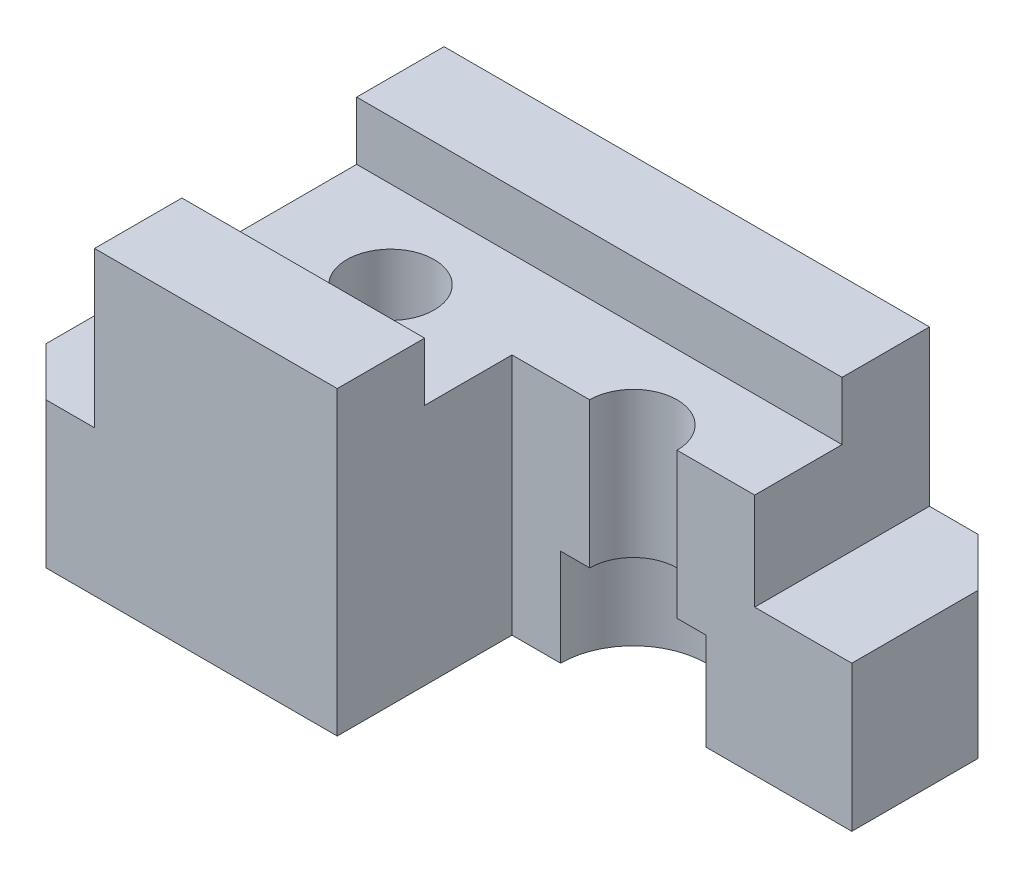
ISO-10303-21;
HEADER;
FILE_DESCRIPTION(('STEP AP214'),'2;1');
FILE_NAME('part.step','',(''),(''),'','','');
FILE_SCHEMA(('AUTOMOTIVE_DESIGN { 1 0 10303 214 1 1 1 1 }'));
ENDSEC;
DATA;
#1=APPLICATION_CONTEXT('core data for automotive mechanical design processes');
#2=APPLICATION_PROTOCOL_DEFINITION('international standard','automotive_design',2000,#1);
#3=PRODUCT_CONTEXT('',#1,'mechanical');
#4=PRODUCT('Part','Part','',(#3));
#5=PRODUCT_RELATED_PRODUCT_CATEGORY('part','',(#4));
#6=PRODUCT_DEFINITION_FORMATION('','',#4);
#7=PRODUCT_DEFINITION_CONTEXT('part definition',#1,'design');
#8=PRODUCT_DEFINITION('design','',#6,#7);
#9=PRODUCT_DEFINITION_SHAPE('','',#8);
#10=(LENGTH_UNIT() NAMED_UNIT(*) SI_UNIT(.MILLI.,.METRE.));
#11=(NAMED_UNIT(*) PLANE_ANGLE_UNIT() SI_UNIT($,.RADIAN.));
#12=(NAMED_UNIT(*) SI_UNIT($,.STERADIAN.) SOLID_ANGLE_UNIT());
#13=UNCERTAINTY_MEASURE_WITH_UNIT(LENGTH_MEASURE(1.E-05),#10,'distance_accuracy_value','');
#14=(GEOMETRIC_REPRESENTATION_CONTEXT(3) GLOBAL_UNCERTAINTY_ASSIGNED_CONTEXT((#13)) GLOBAL_UNIT_ASSIGNED_CONTEXT((#10,
#11,#12)) REPRESENTATION_CONTEXT('',''));
#15=CARTESIAN_POINT('',(0.,0.,0.));
#16=DIRECTION('',(0.,0.,1.));
#17=DIRECTION('',(1.,0.,0.));
#18=AXIS2_PLACEMENT_3D('',#15,#16,#17);
#19=CARTESIAN_POINT('',(70.,0.,-36.));
#20=DIRECTION('',(0.,-1.,0.));
#21=DIRECTION('',(1.,0.,0.));
#22=AXIS2_PLACEMENT_3D('',#19,#20,#21);
#23=PLANE('',#22);
#24=CARTESIAN_POINT('',(22.5,0.,-18.));
#25=DIRECTION('',(0.,-1.,0.));
#26=DIRECTION('',(1.,0.,0.));
#27=AXIS2_PLACEMENT_3D('',#24,#25,#26);
#28=CIRCLE('',#27,7.5);
#29=CARTESIAN_POINT('',(30.,0.,-18.));
#30=VERTEX_POINT('',#29);
#31=EDGE_CURVE('E206',#30,#30,#28,.T.);
#32=ORIENTED_EDGE('',*,*,#31,.F.);
#33=EDGE_LOOP('',(#32));
#34=FACE_BOUND('',#33,.T.);
#35=DIRECTION('',(0.,0.,1.));
#36=VECTOR('',#35,1.);
#37=CARTESIAN_POINT('',(70.,0.,-36.));
#38=LINE('',#37,#36);
#39=CARTESIAN_POINT('',(70.,0.,-30.9999999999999));
#40=VERTEX_POINT('',#39);
#41=CARTESIAN_POINT('',(70.,0.,-18.));
#42=VERTEX_POINT('',#41);
#43=EDGE_CURVE('E309',#40,#42,#38,.T.);
#44=ORIENTED_EDGE('',*,*,#43,.T.);
#45=DIRECTION('',(-1.,0.,0.));
#46=VECTOR('',#45,1.);
#47=CARTESIAN_POINT('',(70.,0.,-18.));
#48=LINE('',#47,#46);
#49=CARTESIAN_POINT('',(55.,0.,-18.));
#50=VERTEX_POINT('',#49);
#51=EDGE_CURVE('E275',#42,#50,#48,.T.);
#52=ORIENTED_EDGE('',*,*,#51,.T.);
#53=CARTESIAN_POINT('',(47.5,0.,-18.));
#54=DIRECTION('',(0.,-1.,0.));
#55=DIRECTION('',(1.,0.,0.));
#56=AXIS2_PLACEMENT_3D('',#53,#54,#55);
#57=CIRCLE('',#56,7.5);
#58=CARTESIAN_POINT('',(40.,0.,-18.));
#59=VERTEX_POINT('',#58);
#60=EDGE_CURVE('E205',#59,#50,#57,.T.);
#61=ORIENTED_EDGE('',*,*,#60,.F.);
#62=CARTESIAN_POINT('',(35.,0.,-18.));
#63=VERTEX_POINT('',#62);
#64=EDGE_CURVE('E272',#59,#63,#48,.T.);
#65=ORIENTED_EDGE('',*,*,#64,.T.);
#66=DIRECTION('',(0.,0.,-1.));
#67=VECTOR('',#66,1.);
#68=CARTESIAN_POINT('',(35.,0.,-36.));
#69=LINE('',#68,#67);
#70=CARTESIAN_POINT('',(35.,0.,0.));
#71=VERTEX_POINT('',#70);
#72=EDGE_CURVE('E177',#71,#63,#69,.T.);
#73=ORIENTED_EDGE('',*,*,#72,.F.);
#74=DIRECTION('',(1.,0.,0.));
#75=VECTOR('',#74,1.);
#76=CARTESIAN_POINT('',(70.,0.,0.));
#77=LINE('',#76,#75);
#78=CARTESIAN_POINT('',(5.00000000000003,0.,0.));
#79=VERTEX_POINT('',#78);
#80=EDGE_CURVE('E187',#79,#71,#77,.T.);
#81=ORIENTED_EDGE('',*,*,#80,.F.);
#82=DIRECTION('',(0.707106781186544,0.,0.707106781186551));
#83=VECTOR('',#82,1.);
#84=CARTESIAN_POINT('',(19.4999999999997,0.,14.4999999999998));
#85=LINE('',#84,#83);
#86=CARTESIAN_POINT('',(0.,0.,-5.00000000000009));
#87=VERTEX_POINT('',#86);
#88=EDGE_CURVE('E231',#79,#87,#85,.F.);
#89=ORIENTED_EDGE('',*,*,#88,.T.);
#90=DIRECTION('',(0.,0.,1.));
#91=VECTOR('',#90,1.);
#92=CARTESIAN_POINT('',(0.,0.,-36.));
#93=LINE('',#92,#91);
#94=CARTESIAN_POINT('',(0.,0.,-30.9999999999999));
#95=VERTEX_POINT('',#94);
#96=EDGE_CURVE('E312',#95,#87,#93,.T.);
#97=ORIENTED_EDGE('',*,*,#96,.F.);
#98=DIRECTION('',(0.707106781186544,0.,-0.707106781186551));
#99=VECTOR('',#98,1.);
#100=CARTESIAN_POINT('',(37.4999999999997,0.,-68.5));
#101=LINE('',#100,#99);
#102=CARTESIAN_POINT('',(5.00000000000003,0.,-36.));
#103=VERTEX_POINT('',#102);
#104=EDGE_CURVE('E229',#95,#103,#101,.T.);
#105=ORIENTED_EDGE('',*,*,#104,.T.);
#106=DIRECTION('',(1.,0.,0.));
#107=VECTOR('',#106,1.);
#108=CARTESIAN_POINT('',(70.,0.,-36.));
#109=LINE('',#108,#107);
#110=CARTESIAN_POINT('',(65.,0.,-36.));
#111=VERTEX_POINT('',#110);
#112=EDGE_CURVE('E308',#103,#111,#109,.T.);
#113=ORIENTED_EDGE('',*,*,#112,.T.);
#114=DIRECTION('',(0.707106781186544,0.,0.707106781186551));
#115=VECTOR('',#114,1.);
#116=CARTESIAN_POINT('',(67.5,0.,-33.5));
#117=LINE('',#116,#115);
#118=EDGE_CURVE('E233',#111,#40,#117,.T.);
#119=ORIENTED_EDGE('',*,*,#118,.T.);
#120=EDGE_LOOP('',(#44,#52,#61,#65,#73,#81,#89,#97,#105,#113,#119));
#121=FACE_BOUND('',#120,.T.);
#122=ADVANCED_FACE('F26',(#34,#121),#23,.T.);
#123=CARTESIAN_POINT('',(60.,31.,-36.));
#124=DIRECTION('',(1.,0.,0.));
#125=DIRECTION('',(0.,1.,0.));
#126=AXIS2_PLACEMENT_3D('',#123,#124,#125);
#127=PLANE('',#126);
#128=DIRECTION('',(0.,0.,-1.));
#129=VECTOR('',#128,1.);
#130=CARTESIAN_POINT('',(60.,25.,-9.));
#131=LINE('',#130,#129);
#132=CARTESIAN_POINT('',(60.,25.,-18.));
#133=VERTEX_POINT('',#132);
#134=CARTESIAN_POINT('',(60.,25.,-27.));
#135=VERTEX_POINT('',#134);
#136=EDGE_CURVE('E286',#133,#135,#131,.T.);
#137=ORIENTED_EDGE('',*,*,#136,.F.);
#138=DIRECTION('',(0.,-1.,0.));
#139=VECTOR('',#138,1.);
#140=CARTESIAN_POINT('',(60.,31.,-18.));
#141=LINE('',#140,#139);
#142=CARTESIAN_POINT('',(60.,15.,-18.));
#143=VERTEX_POINT('',#142);
#144=EDGE_CURVE('E40',#133,#143,#141,.T.);
#145=ORIENTED_EDGE('',*,*,#144,.T.);
#146=DIRECTION('',(0.,0.,1.));
#147=VECTOR('',#146,1.);
#148=CARTESIAN_POINT('',(60.,15.,-36.));
#149=LINE('',#148,#147);
#150=CARTESIAN_POINT('',(60.,15.,-36.));
#151=VERTEX_POINT('',#150);
#152=EDGE_CURVE('E315',#151,#143,#149,.T.);
#153=ORIENTED_EDGE('',*,*,#152,.F.);
#154=DIRECTION('',(0.,1.,0.));
#155=VECTOR('',#154,1.);
#156=CARTESIAN_POINT('',(60.,31.,-36.));
#157=LINE('',#156,#155);
#158=CARTESIAN_POINT('',(60.,31.,-36.));
#159=VERTEX_POINT('',#158);
#160=EDGE_CURVE('E322',#151,#159,#157,.T.);
#161=ORIENTED_EDGE('',*,*,#160,.T.);
#162=DIRECTION('',(0.,0.,1.));
#163=VECTOR('',#162,1.);
#164=CARTESIAN_POINT('',(60.,31.,-36.));
#165=LINE('',#164,#163);
#166=CARTESIAN_POINT('',(60.,31.,-27.));
#167=VERTEX_POINT('',#166);
#168=EDGE_CURVE('E319',#159,#167,#165,.T.);
#169=ORIENTED_EDGE('',*,*,#168,.T.);
#170=DIRECTION('',(0.,1.,0.));
#171=VECTOR('',#170,1.);
#172=CARTESIAN_POINT('',(60.,32.0164446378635,-27.));
#173=LINE('',#172,#171);
#174=EDGE_CURVE('E288',#135,#167,#173,.T.);
#175=ORIENTED_EDGE('',*,*,#174,.F.);
#176=EDGE_LOOP('',(#137,#145,#153,#161,#169,#175));
#177=FACE_BOUND('',#176,.T.);
#178=ADVANCED_FACE('F386',(#177),#127,.T.);
#179=CARTESIAN_POINT('',(60.,15.,-36.));
#180=DIRECTION('',(0.,1.,0.));
#181=DIRECTION('',(0.,0.,1.));
#182=AXIS2_PLACEMENT_3D('',#179,#180,#181);
#183=PLANE('',#182);
#184=ORIENTED_EDGE('',*,*,#152,.T.);
#185=DIRECTION('',(1.,0.,0.));
#186=VECTOR('',#185,1.);
#187=CARTESIAN_POINT('',(60.,15.,-18.));
#188=LINE('',#187,#186);
#189=CARTESIAN_POINT('',(70.,15.,-18.));
#190=VERTEX_POINT('',#189);
#191=EDGE_CURVE('E283',#143,#190,#188,.T.);
#192=ORIENTED_EDGE('',*,*,#191,.T.);
#193=DIRECTION('',(0.,0.,1.));
#194=VECTOR('',#193,1.);
#195=CARTESIAN_POINT('',(70.,15.,-36.));
#196=LINE('',#195,#194);
#197=CARTESIAN_POINT('',(70.,15.,-30.9999999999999));
#198=VERTEX_POINT('',#197);
#199=EDGE_CURVE('E198',#198,#190,#196,.T.);
#200=ORIENTED_EDGE('',*,*,#199,.F.);
#201=DIRECTION('',(-0.707106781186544,0.,-0.707106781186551));
#202=VECTOR('',#201,1.);
#203=CARTESIAN_POINT('',(62.5,15.,-38.5));
#204=LINE('',#203,#202);
#205=CARTESIAN_POINT('',(65.,15.,-36.));
#206=VERTEX_POINT('',#205);
#207=EDGE_CURVE('E224',#198,#206,#204,.T.);
#208=ORIENTED_EDGE('',*,*,#207,.T.);
#209=DIRECTION('',(-1.,0.,0.));
#210=VECTOR('',#209,1.);
#211=CARTESIAN_POINT('',(60.,15.,-36.));
#212=LINE('',#211,#210);
#213=EDGE_CURVE('E318',#206,#151,#212,.T.);
#214=ORIENTED_EDGE('',*,*,#213,.T.);
#215=EDGE_LOOP('',(#184,#192,#200,#208,#214));
#216=FACE_BOUND('',#215,.T.);
#217=ADVANCED_FACE('F382',(#216),#183,.T.);
#218=CARTESIAN_POINT('',(70.,15.,-36.));
#219=DIRECTION('',(1.,0.,0.));
#220=DIRECTION('',(0.,0.,-1.));
#221=AXIS2_PLACEMENT_3D('',#218,#219,#220);
#222=PLANE('',#221);
#223=ORIENTED_EDGE('',*,*,#199,.T.);
#224=DIRECTION('',(0.,-1.,0.));
#225=VECTOR('',#224,1.);
#226=CARTESIAN_POINT('',(70.,15.,-18.));
#227=LINE('',#226,#225);
#228=EDGE_CURVE('E280',#190,#42,#227,.T.);
#229=ORIENTED_EDGE('',*,*,#228,.T.);
#230=ORIENTED_EDGE('',*,*,#43,.F.);
#231=DIRECTION('',(0.,1.,0.));
#232=VECTOR('',#231,1.);
#233=CARTESIAN_POINT('',(70.,15.,-30.9999999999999));
#234=LINE('',#233,#232);
#235=EDGE_CURVE('E226',#40,#198,#234,.T.);
#236=ORIENTED_EDGE('',*,*,#235,.T.);
#237=EDGE_LOOP('',(#223,#229,#230,#236));
#238=FACE_BOUND('',#237,.T.);
#239=ADVANCED_FACE('F378',(#238),#222,.T.);
#240=CARTESIAN_POINT('',(47.5,10.,-18.));
#241=DIRECTION('',(0.,-1.,0.));
#242=DIRECTION('',(1.,0.,0.));
#243=AXIS2_PLACEMENT_3D('',#240,#241,#242);
#244=CYLINDRICAL_SURFACE('',#243,7.5);
#245=DIRECTION('',(0.,-1.,0.));
#246=VECTOR('',#245,1.);
#247=CARTESIAN_POINT('',(40.,10.,-18.));
#248=LINE('',#247,#246);
#249=CARTESIAN_POINT('',(40.,10.,-18.));
#250=VERTEX_POINT('',#249);
#251=EDGE_CURVE('E269',#59,#250,#248,.F.);
#252=ORIENTED_EDGE('',*,*,#251,.F.);
#253=ORIENTED_EDGE('',*,*,#60,.T.);
#254=DIRECTION('',(0.,-1.,0.));
#255=VECTOR('',#254,1.);
#256=CARTESIAN_POINT('',(55.,10.,-18.));
#257=LINE('',#256,#255);
#258=CARTESIAN_POINT('',(55.,10.,-18.));
#259=VERTEX_POINT('',#258);
#260=EDGE_CURVE('E277',#259,#50,#257,.T.);
#261=ORIENTED_EDGE('',*,*,#260,.F.);
#262=CARTESIAN_POINT('',(47.5,10.,-18.));
#263=DIRECTION('',(0.,-1.,0.));
#264=DIRECTION('',(1.,0.,0.));
#265=AXIS2_PLACEMENT_3D('',#262,#263,#264);
#266=CIRCLE('',#265,7.5);
#267=EDGE_CURVE('E209',#250,#259,#266,.T.);
#268=ORIENTED_EDGE('',*,*,#267,.F.);
#269=EDGE_LOOP('',(#252,#253,#261,#268));
#270=FACE_BOUND('',#269,.T.);
#271=ADVANCED_FACE('F429',(#270),#244,.F.);
#272=CARTESIAN_POINT('',(47.5,10.,-18.));
#273=DIRECTION('',(0.,-1.,0.));
#274=DIRECTION('',(1.,0.,0.));
#275=AXIS2_PLACEMENT_3D('',#272,#273,#274);
#276=PLANE('',#275);
#277=ORIENTED_EDGE('',*,*,#267,.T.);
#278=DIRECTION('',(-1.,0.,0.));
#279=VECTOR('',#278,1.);
#280=CARTESIAN_POINT('',(47.5,10.,-18.));
#281=LINE('',#280,#279);
#282=CARTESIAN_POINT('',(52.,10.,-18.));
#283=VERTEX_POINT('',#282);
#284=EDGE_CURVE('E270',#259,#283,#281,.T.);
#285=ORIENTED_EDGE('',*,*,#284,.T.);
#286=CARTESIAN_POINT('',(47.5,10.,-18.));
#287=DIRECTION('',(0.,-1.,0.));
#288=DIRECTION('',(1.,0.,0.));
#289=AXIS2_PLACEMENT_3D('',#286,#287,#288);
#290=CIRCLE('',#289,4.5);
#291=CARTESIAN_POINT('',(43.,10.,-18.));
#292=VERTEX_POINT('',#291);
#293=EDGE_CURVE('E305',#292,#283,#290,.T.);
#294=ORIENTED_EDGE('',*,*,#293,.F.);
#295=EDGE_CURVE('E266',#292,#250,#281,.T.);
#296=ORIENTED_EDGE('',*,*,#295,.T.);
#297=EDGE_LOOP('',(#277,#285,#294,#296));
#298=FACE_BOUND('',#297,.T.);
#299=ADVANCED_FACE('F448',(#298),#276,.T.);
#300=CARTESIAN_POINT('',(47.5,31.001,-18.));
#301=DIRECTION('',(0.,-1.,0.));
#302=DIRECTION('',(1.,0.,0.));
#303=AXIS2_PLACEMENT_3D('',#300,#301,#302);
#304=CYLINDRICAL_SURFACE('',#303,4.5);
#305=DIRECTION('',(0.,-1.,0.));
#306=VECTOR('',#305,1.);
#307=CARTESIAN_POINT('',(43.,31.001,-18.));
#308=LINE('',#307,#306);
#309=CARTESIAN_POINT('',(43.,25.,-18.));
#310=VERTEX_POINT('',#309);
#311=EDGE_CURVE('E256',#292,#310,#308,.F.);
#312=ORIENTED_EDGE('',*,*,#311,.F.);
#313=ORIENTED_EDGE('',*,*,#293,.T.);
#314=DIRECTION('',(0.,-1.,0.));
#315=VECTOR('',#314,1.);
#316=CARTESIAN_POINT('',(52.,31.001,-18.));
#317=LINE('',#316,#315);
#318=CARTESIAN_POINT('',(52.,25.,-18.));
#319=VERTEX_POINT('',#318);
#320=EDGE_CURVE('E274',#319,#283,#317,.T.);
#321=ORIENTED_EDGE('',*,*,#320,.F.);
#322=CARTESIAN_POINT('',(47.5,25.,-18.));
#323=DIRECTION('',(0.,-1.,0.));
#324=DIRECTION('',(1.,0.,0.));
#325=AXIS2_PLACEMENT_3D('',#322,#323,#324);
#326=CIRCLE('',#325,4.5);
#327=EDGE_CURVE('E218',#319,#310,#326,.F.);
#328=ORIENTED_EDGE('',*,*,#327,.T.);
#329=EDGE_LOOP('',(#312,#313,#321,#328));
#330=FACE_BOUND('',#329,.T.);
#331=ADVANCED_FACE('F426',(#330),#304,.F.);
#332=CARTESIAN_POINT('',(0.,25.,-9.));
#333=DIRECTION('',(0.,-1.,0.));
#334=DIRECTION('',(1.,0.,0.));
#335=AXIS2_PLACEMENT_3D('',#332,#333,#334);
#336=PLANE('',#335);
#337=CARTESIAN_POINT('',(22.4845869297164,25.,-18.));
#338=DIRECTION('',(0.,-1.,0.));
#339=DIRECTION('',(1.,0.,0.));
#340=AXIS2_PLACEMENT_3D('',#337,#338,#339);
#341=CIRCLE('',#340,4.5);
#342=CARTESIAN_POINT('',(26.9845869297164,25.,-18.));
#343=VERTEX_POINT('',#342);
#344=EDGE_CURVE('E221',#343,#343,#341,.F.);
#345=ORIENTED_EDGE('',*,*,#344,.F.);
#346=EDGE_LOOP('',(#345));
#347=FACE_BOUND('',#346,.T.);
#348=DIRECTION('',(-1.,0.,0.));
#349=VECTOR('',#348,1.);
#350=CARTESIAN_POINT('',(0.,25.,-18.));
#351=LINE('',#350,#349);
#352=EDGE_CURVE('E11',#133,#319,#351,.T.);
#353=ORIENTED_EDGE('',*,*,#352,.F.);
#354=ORIENTED_EDGE('',*,*,#136,.T.);
#355=DIRECTION('',(1.,0.,0.));
#356=VECTOR('',#355,1.);
#357=CARTESIAN_POINT('',(0.,25.,-27.));
#358=LINE('',#357,#356);
#359=CARTESIAN_POINT('',(10.,25.,-27.));
#360=VERTEX_POINT('',#359);
#361=EDGE_CURVE('E222',#360,#135,#358,.T.);
#362=ORIENTED_EDGE('',*,*,#361,.F.);
#363=DIRECTION('',(0.,0.,1.));
#364=VECTOR('',#363,1.);
#365=CARTESIAN_POINT('',(10.,25.,-36.));
#366=LINE('',#365,#364);
#367=CARTESIAN_POINT('',(10.,25.,-9.));
#368=VERTEX_POINT('',#367);
#369=EDGE_CURVE('E295',#360,#368,#366,.T.);
#370=ORIENTED_EDGE('',*,*,#369,.T.);
#371=DIRECTION('',(1.,0.,0.));
#372=VECTOR('',#371,1.);
#373=CARTESIAN_POINT('',(0.,25.,-9.));
#374=LINE('',#373,#372);
#375=CARTESIAN_POINT('',(35.,25.,-9.));
#376=VERTEX_POINT('',#375);
#377=EDGE_CURVE('E261',#368,#376,#374,.T.);
#378=ORIENTED_EDGE('',*,*,#377,.T.);
#379=DIRECTION('',(0.,0.,-1.));
#380=VECTOR('',#379,1.);
#381=CARTESIAN_POINT('',(35.,25.,-9.));
#382=LINE('',#381,#380);
#383=CARTESIAN_POINT('',(35.,25.,-18.));
#384=VERTEX_POINT('',#383);
#385=EDGE_CURVE('E48',#376,#384,#382,.T.);
#386=ORIENTED_EDGE('',*,*,#385,.T.);
#387=EDGE_CURVE('E30',#310,#384,#351,.T.);
#388=ORIENTED_EDGE('',*,*,#387,.F.);
#389=ORIENTED_EDGE('',*,*,#327,.F.);
#390=EDGE_LOOP('',(#353,#354,#362,#370,#378,#386,#388,#389));
#391=FACE_BOUND('',#390,.T.);
#392=ADVANCED_FACE('F260',(#347,#391),#336,.F.);
#393=CARTESIAN_POINT('',(10.,31.,-36.));
#394=DIRECTION('',(0.,1.,0.));
#395=DIRECTION('',(0.,0.,1.));
#396=AXIS2_PLACEMENT_3D('',#393,#394,#395);
#397=PLANE('',#396);
#398=DIRECTION('',(0.,0.,1.));
#399=VECTOR('',#398,1.);
#400=CARTESIAN_POINT('',(35.,31.,-36.));
#401=LINE('',#400,#399);
#402=CARTESIAN_POINT('',(35.,31.,-9.));
#403=VERTEX_POINT('',#402);
#404=CARTESIAN_POINT('',(35.,31.,0.));
#405=VERTEX_POINT('',#404);
#406=EDGE_CURVE('E167',#403,#405,#401,.T.);
#407=ORIENTED_EDGE('',*,*,#406,.F.);
#408=DIRECTION('',(1.,0.,0.));
#409=VECTOR('',#408,1.);
#410=CARTESIAN_POINT('',(10.,31.,-9.));
#411=LINE('',#410,#409);
#412=CARTESIAN_POINT('',(10.,31.,-9.));
#413=VERTEX_POINT('',#412);
#414=EDGE_CURVE('E301',#413,#403,#411,.T.);
#415=ORIENTED_EDGE('',*,*,#414,.F.);
#416=DIRECTION('',(0.,0.,1.));
#417=VECTOR('',#416,1.);
#418=CARTESIAN_POINT('',(10.,31.,-36.));
#419=LINE('',#418,#417);
#420=CARTESIAN_POINT('',(10.,31.,0.));
#421=VERTEX_POINT('',#420);
#422=EDGE_CURVE('E192',#413,#421,#419,.T.);
#423=ORIENTED_EDGE('',*,*,#422,.T.);
#424=DIRECTION('',(-1.,0.,0.));
#425=VECTOR('',#424,1.);
#426=CARTESIAN_POINT('',(10.,31.,0.));
#427=LINE('',#426,#425);
#428=EDGE_CURVE('E183',#405,#421,#427,.T.);
#429=ORIENTED_EDGE('',*,*,#428,.F.);
#430=EDGE_LOOP('',(#407,#415,#423,#429));
#431=FACE_BOUND('',#430,.T.);
#432=ADVANCED_FACE('F190',(#431),#397,.T.);
#433=CARTESIAN_POINT('',(0.,0.,-36.));
#434=DIRECTION('',(-1.,0.,0.));
#435=DIRECTION('',(0.,0.,1.));
#436=AXIS2_PLACEMENT_3D('',#433,#434,#435);
#437=PLANE('',#436);
#438=ORIENTED_EDGE('',*,*,#96,.T.);
#439=DIRECTION('',(0.,1.,0.));
#440=VECTOR('',#439,1.);
#441=CARTESIAN_POINT('',(0.,0.,-5.00000000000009));
#442=LINE('',#441,#440);
#443=CARTESIAN_POINT('',(0.,15.,-5.00000000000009));
#444=VERTEX_POINT('',#443);
#445=EDGE_CURVE('E242',#87,#444,#442,.T.);
#446=ORIENTED_EDGE('',*,*,#445,.T.);
#447=DIRECTION('',(0.,0.,1.));
#448=VECTOR('',#447,1.);
#449=CARTESIAN_POINT('',(0.,15.,-36.));
#450=LINE('',#449,#448);
#451=CARTESIAN_POINT('',(0.,15.,-30.9999999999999));
#452=VERTEX_POINT('',#451);
#453=EDGE_CURVE('E330',#452,#444,#450,.T.);
#454=ORIENTED_EDGE('',*,*,#453,.F.);
#455=DIRECTION('',(0.,-1.,0.));
#456=VECTOR('',#455,1.);
#457=CARTESIAN_POINT('',(0.,0.,-30.9999999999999));
#458=LINE('',#457,#456);
#459=EDGE_CURVE('E239',#452,#95,#458,.T.);
#460=ORIENTED_EDGE('',*,*,#459,.T.);
#461=EDGE_LOOP('',(#438,#446,#454,#460));
#462=FACE_BOUND('',#461,.T.);
#463=ADVANCED_FACE('F357',(#462),#437,.T.);
#464=CARTESIAN_POINT('',(0.,15.,-36.));
#465=DIRECTION('',(0.,1.,0.));
#466=DIRECTION('',(0.,0.,1.));
#467=AXIS2_PLACEMENT_3D('',#464,#465,#466);
#468=PLANE('',#467);
#469=ORIENTED_EDGE('',*,*,#453,.T.);
#470=DIRECTION('',(-0.707106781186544,0.,-0.707106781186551));
#471=VECTOR('',#470,1.);
#472=CARTESIAN_POINT('',(-15.5,15.,-20.5000000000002));
#473=LINE('',#472,#471);
#474=CARTESIAN_POINT('',(5.00000000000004,15.,0.));
#475=VERTEX_POINT('',#474);
#476=EDGE_CURVE('E246',#444,#475,#473,.F.);
#477=ORIENTED_EDGE('',*,*,#476,.T.);
#478=DIRECTION('',(-1.,0.,0.));
#479=VECTOR('',#478,1.);
#480=CARTESIAN_POINT('',(0.,15.,0.));
#481=LINE('',#480,#479);
#482=CARTESIAN_POINT('',(10.,15.,0.));
#483=VERTEX_POINT('',#482);
#484=EDGE_CURVE('E196',#483,#475,#481,.T.);
#485=ORIENTED_EDGE('',*,*,#484,.F.);
#486=DIRECTION('',(0.,0.,1.));
#487=VECTOR('',#486,1.);
#488=CARTESIAN_POINT('',(10.,15.,-36.));
#489=LINE('',#488,#487);
#490=CARTESIAN_POINT('',(10.,15.,-36.));
#491=VERTEX_POINT('',#490);
#492=EDGE_CURVE('E326',#491,#483,#489,.T.);
#493=ORIENTED_EDGE('',*,*,#492,.F.);
#494=DIRECTION('',(-1.,0.,0.));
#495=VECTOR('',#494,1.);
#496=CARTESIAN_POINT('',(0.,15.,-36.));
#497=LINE('',#496,#495);
#498=CARTESIAN_POINT('',(5.00000000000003,15.,-36.));
#499=VERTEX_POINT('',#498);
#500=EDGE_CURVE('E333',#491,#499,#497,.T.);
#501=ORIENTED_EDGE('',*,*,#500,.T.);
#502=DIRECTION('',(-0.707106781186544,0.,0.707106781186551));
#503=VECTOR('',#502,1.);
#504=CARTESIAN_POINT('',(2.50000000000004,15.,-33.5));
#505=LINE('',#504,#503);
#506=EDGE_CURVE('E244',#499,#452,#505,.T.);
#507=ORIENTED_EDGE('',*,*,#506,.T.);
#508=EDGE_LOOP('',(#469,#477,#485,#493,#501,#507));
#509=FACE_BOUND('',#508,.T.);
#510=ADVANCED_FACE('F434',(#509),#468,.T.);
#511=CARTESIAN_POINT('',(10.,15.,-36.));
#512=DIRECTION('',(-1.,0.,0.));
#513=DIRECTION('',(0.,0.,1.));
#514=AXIS2_PLACEMENT_3D('',#511,#512,#513);
#515=PLANE('',#514);
#516=DIRECTION('',(0.,1.,0.));
#517=VECTOR('',#516,1.);
#518=CARTESIAN_POINT('',(10.,15.,-9.));
#519=LINE('',#518,#517);
#520=EDGE_CURVE('E303',#368,#413,#519,.T.);
#521=ORIENTED_EDGE('',*,*,#520,.F.);
#522=ORIENTED_EDGE('',*,*,#369,.F.);
#523=DIRECTION('',(0.,-1.,0.));
#524=VECTOR('',#523,1.);
#525=CARTESIAN_POINT('',(10.,15.,-27.));
#526=LINE('',#525,#524);
#527=CARTESIAN_POINT('',(10.,31.,-27.));
#528=VERTEX_POINT('',#527);
#529=EDGE_CURVE('E299',#528,#360,#526,.T.);
#530=ORIENTED_EDGE('',*,*,#529,.F.);
#531=CARTESIAN_POINT('',(10.,31.,-36.));
#532=VERTEX_POINT('',#531);
#533=EDGE_CURVE('E323',#532,#528,#419,.T.);
#534=ORIENTED_EDGE('',*,*,#533,.F.);
#535=DIRECTION('',(0.,-1.,0.));
#536=VECTOR('',#535,1.);
#537=CARTESIAN_POINT('',(10.,15.,-36.));
#538=LINE('',#537,#536);
#539=EDGE_CURVE('E329',#532,#491,#538,.T.);
#540=ORIENTED_EDGE('',*,*,#539,.T.);
#541=ORIENTED_EDGE('',*,*,#492,.T.);
#542=DIRECTION('',(0.,-1.,0.));
#543=VECTOR('',#542,1.);
#544=CARTESIAN_POINT('',(10.,15.,0.));
#545=LINE('',#544,#543);
#546=EDGE_CURVE('E194',#421,#483,#545,.T.);
#547=ORIENTED_EDGE('',*,*,#546,.F.);
#548=ORIENTED_EDGE('',*,*,#422,.F.);
#549=EDGE_LOOP('',(#521,#522,#530,#534,#540,#541,#547,#548));
#550=FACE_BOUND('',#549,.T.);
#551=ADVANCED_FACE('F399',(#550),#515,.T.);
#552=DIRECTION('',(-1.,0.,0.));
#553=VECTOR('',#552,1.);
#554=CARTESIAN_POINT('',(10.,31.,-27.));
#555=LINE('',#554,#553);
#556=EDGE_CURVE('E297',#167,#528,#555,.T.);
#557=ORIENTED_EDGE('',*,*,#556,.F.);
#558=ORIENTED_EDGE('',*,*,#168,.F.);
#559=DIRECTION('',(-1.,0.,0.));
#560=VECTOR('',#559,1.);
#561=CARTESIAN_POINT('',(10.,31.,-36.));
#562=LINE('',#561,#560);
#563=EDGE_CURVE('E328',#159,#532,#562,.T.);
#564=ORIENTED_EDGE('',*,*,#563,.T.);
#565=ORIENTED_EDGE('',*,*,#533,.T.);
#566=EDGE_LOOP('',(#557,#558,#564,#565));
#567=FACE_BOUND('',#566,.T.);
#568=ADVANCED_FACE('F28',(#567),#397,.T.);
#569=CARTESIAN_POINT('',(70.,0.,-36.));
#570=DIRECTION('',(0.,0.,1.));
#571=DIRECTION('',(1.,0.,0.));
#572=AXIS2_PLACEMENT_3D('',#569,#570,#571);
#573=PLANE('',#572);
#574=ORIENTED_EDGE('',*,*,#213,.F.);
#575=DIRECTION('',(0.,-1.,0.));
#576=VECTOR('',#575,1.);
#577=CARTESIAN_POINT('',(65.,0.,-36.));
#578=LINE('',#577,#576);
#579=EDGE_CURVE('E237',#206,#111,#578,.T.);
#580=ORIENTED_EDGE('',*,*,#579,.T.);
#581=ORIENTED_EDGE('',*,*,#112,.F.);
#582=DIRECTION('',(0.,1.,0.));
#583=VECTOR('',#582,1.);
#584=CARTESIAN_POINT('',(5.00000000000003,15.,-36.));
#585=LINE('',#584,#583);
#586=EDGE_CURVE('E235',#103,#499,#585,.T.);
#587=ORIENTED_EDGE('',*,*,#586,.T.);
#588=ORIENTED_EDGE('',*,*,#500,.F.);
#589=ORIENTED_EDGE('',*,*,#539,.F.);
#590=ORIENTED_EDGE('',*,*,#563,.F.);
#591=ORIENTED_EDGE('',*,*,#160,.F.);
#592=EDGE_LOOP('',(#574,#580,#581,#587,#588,#589,#590,#591));
#593=FACE_BOUND('',#592,.T.);
#594=ADVANCED_FACE('F368',(#593),#573,.F.);
#595=CARTESIAN_POINT('',(70.,0.,0.));
#596=DIRECTION('',(0.,0.,1.));
#597=DIRECTION('',(1.,0.,0.));
#598=AXIS2_PLACEMENT_3D('',#595,#596,#597);
#599=PLANE('',#598);
#600=DIRECTION('',(0.,-1.,0.));
#601=VECTOR('',#600,1.);
#602=CARTESIAN_POINT('',(35.,34.1156648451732,0.));
#603=LINE('',#602,#601);
#604=EDGE_CURVE('E170',#405,#71,#603,.T.);
#605=ORIENTED_EDGE('',*,*,#604,.F.);
#606=ORIENTED_EDGE('',*,*,#428,.T.);
#607=ORIENTED_EDGE('',*,*,#546,.T.);
#608=ORIENTED_EDGE('',*,*,#484,.T.);
#609=DIRECTION('',(0.,-1.,0.));
#610=VECTOR('',#609,1.);
#611=CARTESIAN_POINT('',(5.00000000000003,0.,0.));
#612=LINE('',#611,#610);
#613=EDGE_CURVE('E217',#475,#79,#612,.T.);
#614=ORIENTED_EDGE('',*,*,#613,.T.);
#615=ORIENTED_EDGE('',*,*,#80,.T.);
#616=EDGE_LOOP('',(#605,#606,#607,#608,#614,#615));
#617=FACE_BOUND('',#616,.T.);
#618=ADVANCED_FACE('F181',(#617),#599,.T.);
#619=CARTESIAN_POINT('',(22.5,10.,-18.));
#620=DIRECTION('',(0.,-1.,0.));
#621=DIRECTION('',(1.,0.,0.));
#622=AXIS2_PLACEMENT_3D('',#619,#620,#621);
#623=CYLINDRICAL_SURFACE('',#622,7.5);
#624=CARTESIAN_POINT('',(22.5,10.,-18.));
#625=DIRECTION('',(0.,-1.,0.));
#626=DIRECTION('',(1.,0.,0.));
#627=AXIS2_PLACEMENT_3D('',#624,#625,#626);
#628=CIRCLE('',#627,7.5);
#629=CARTESIAN_POINT('',(30.,10.,-18.));
#630=VERTEX_POINT('',#629);
#631=EDGE_CURVE('E202',#630,#630,#628,.T.);
#632=ORIENTED_EDGE('',*,*,#631,.F.);
#633=EDGE_LOOP('',(#632));
#634=FACE_BOUND('',#633,.T.);
#635=ORIENTED_EDGE('',*,*,#31,.T.);
#636=EDGE_LOOP('',(#635));
#637=FACE_BOUND('',#636,.T.);
#638=ADVANCED_FACE('F442',(#634,#637),#623,.F.);
#639=CARTESIAN_POINT('',(22.5,10.,-18.));
#640=DIRECTION('',(0.,-1.,0.));
#641=DIRECTION('',(1.,0.,0.));
#642=AXIS2_PLACEMENT_3D('',#639,#640,#641);
#643=PLANE('',#642);
#644=CARTESIAN_POINT('',(22.4845869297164,10.,-18.));
#645=DIRECTION('',(0.,-1.,0.));
#646=DIRECTION('',(1.,0.,0.));
#647=AXIS2_PLACEMENT_3D('',#644,#645,#646);
#648=CIRCLE('',#647,4.5);
#649=CARTESIAN_POINT('',(26.9845869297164,10.,-18.));
#650=VERTEX_POINT('',#649);
#651=EDGE_CURVE('E212',#650,#650,#648,.T.);
#652=ORIENTED_EDGE('',*,*,#651,.F.);
#653=EDGE_LOOP('',(#652));
#654=FACE_BOUND('',#653,.T.);
#655=ORIENTED_EDGE('',*,*,#631,.T.);
#656=EDGE_LOOP('',(#655));
#657=FACE_BOUND('',#656,.T.);
#658=ADVANCED_FACE('F411',(#654,#657),#643,.T.);
#659=CARTESIAN_POINT('',(22.4845869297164,31.001,-18.));
#660=DIRECTION('',(0.,-1.,0.));
#661=DIRECTION('',(1.,0.,0.));
#662=AXIS2_PLACEMENT_3D('',#659,#660,#661);
#663=CYLINDRICAL_SURFACE('',#662,4.5);
#664=ORIENTED_EDGE('',*,*,#344,.T.);
#665=EDGE_LOOP('',(#664));
#666=FACE_BOUND('',#665,.T.);
#667=ORIENTED_EDGE('',*,*,#651,.T.);
#668=EDGE_LOOP('',(#667));
#669=FACE_BOUND('',#668,.T.);
#670=ADVANCED_FACE('F402',(#666,#669),#663,.F.);
#671=CARTESIAN_POINT('',(0.,32.0164446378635,-9.));
#672=DIRECTION('',(0.,0.,1.));
#673=DIRECTION('',(0.,-1.,0.));
#674=AXIS2_PLACEMENT_3D('',#671,#672,#673);
#675=PLANE('',#674);
#676=ORIENTED_EDGE('',*,*,#414,.T.);
#677=DIRECTION('',(0.,-1.,0.));
#678=VECTOR('',#677,1.);
#679=CARTESIAN_POINT('',(35.,32.0164446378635,-9.));
#680=LINE('',#679,#678);
#681=EDGE_CURVE('E172',#403,#376,#680,.T.);
#682=ORIENTED_EDGE('',*,*,#681,.T.);
#683=ORIENTED_EDGE('',*,*,#377,.F.);
#684=ORIENTED_EDGE('',*,*,#520,.T.);
#685=EDGE_LOOP('',(#676,#682,#683,#684));
#686=FACE_BOUND('',#685,.T.);
#687=ADVANCED_FACE('F400',(#686),#675,.F.);
#688=CARTESIAN_POINT('',(0.,32.0164446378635,-27.));
#689=DIRECTION('',(0.,0.,-1.));
#690=DIRECTION('',(-1.,0.,0.));
#691=AXIS2_PLACEMENT_3D('',#688,#689,#690);
#692=PLANE('',#691);
#693=ORIENTED_EDGE('',*,*,#529,.T.);
#694=ORIENTED_EDGE('',*,*,#361,.T.);
#695=ORIENTED_EDGE('',*,*,#174,.T.);
#696=ORIENTED_EDGE('',*,*,#556,.T.);
#697=EDGE_LOOP('',(#693,#694,#695,#696));
#698=FACE_BOUND('',#697,.T.);
#699=ADVANCED_FACE('F393',(#698),#692,.F.);
#700=CARTESIAN_POINT('',(70.,15.,-30.9999999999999));
#701=DIRECTION('',(0.707106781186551,0.,-0.707106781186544));
#702=DIRECTION('',(-0.707106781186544,0.,-0.707106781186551));
#703=AXIS2_PLACEMENT_3D('',#700,#701,#702);
#704=PLANE('',#703);
#705=ORIENTED_EDGE('',*,*,#118,.F.);
#706=ORIENTED_EDGE('',*,*,#579,.F.);
#707=ORIENTED_EDGE('',*,*,#207,.F.);
#708=ORIENTED_EDGE('',*,*,#235,.F.);
#709=EDGE_LOOP('',(#705,#706,#707,#708));
#710=FACE_BOUND('',#709,.T.);
#711=ADVANCED_FACE('F373',(#710),#704,.T.);
#712=CARTESIAN_POINT('',(5.00000000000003,0.,0.));
#713=DIRECTION('',(0.707106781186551,0.,-0.707106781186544));
#714=DIRECTION('',(-0.707106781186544,0.,-0.707106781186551));
#715=AXIS2_PLACEMENT_3D('',#712,#713,#714);
#716=PLANE('',#715);
#717=ORIENTED_EDGE('',*,*,#476,.F.);
#718=ORIENTED_EDGE('',*,*,#445,.F.);
#719=ORIENTED_EDGE('',*,*,#88,.F.);
#720=ORIENTED_EDGE('',*,*,#613,.F.);
#721=EDGE_LOOP('',(#717,#718,#719,#720));
#722=FACE_BOUND('',#721,.T.);
#723=ADVANCED_FACE('F352',(#722),#716,.F.);
#724=CARTESIAN_POINT('',(0.,0.,-30.9999999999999));
#725=DIRECTION('',(-0.707106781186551,0.,-0.707106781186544));
#726=DIRECTION('',(-0.707106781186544,0.,0.707106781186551));
#727=AXIS2_PLACEMENT_3D('',#724,#725,#726);
#728=PLANE('',#727);
#729=ORIENTED_EDGE('',*,*,#506,.F.);
#730=ORIENTED_EDGE('',*,*,#586,.F.);
#731=ORIENTED_EDGE('',*,*,#104,.F.);
#732=ORIENTED_EDGE('',*,*,#459,.F.);
#733=EDGE_LOOP('',(#729,#730,#731,#732));
#734=FACE_BOUND('',#733,.T.);
#735=ADVANCED_FACE('F362',(#734),#728,.T.);
#736=CARTESIAN_POINT('',(35.,34.1156648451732,-18.));
#737=DIRECTION('',(-1.,0.,0.));
#738=DIRECTION('',(0.,0.,1.));
#739=AXIS2_PLACEMENT_3D('',#736,#737,#738);
#740=PLANE('',#739);
#741=ORIENTED_EDGE('',*,*,#72,.T.);
#742=DIRECTION('',(0.,-1.,0.));
#743=VECTOR('',#742,1.);
#744=CARTESIAN_POINT('',(35.,34.1156648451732,-18.));
#745=LINE('',#744,#743);
#746=EDGE_CURVE('E188',#384,#63,#745,.T.);
#747=ORIENTED_EDGE('',*,*,#746,.F.);
#748=ORIENTED_EDGE('',*,*,#385,.F.);
#749=ORIENTED_EDGE('',*,*,#681,.F.);
#750=ORIENTED_EDGE('',*,*,#406,.T.);
#751=ORIENTED_EDGE('',*,*,#604,.T.);
#752=EDGE_LOOP('',(#741,#747,#748,#749,#750,#751));
#753=FACE_BOUND('',#752,.T.);
#754=ADVANCED_FACE('F169',(#753),#740,.F.);
#755=CARTESIAN_POINT('',(35.,-1.67061323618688,-18.));
#756=DIRECTION('',(0.,0.,1.));
#757=DIRECTION('',(1.,0.,0.));
#758=AXIS2_PLACEMENT_3D('',#755,#756,#757);
#759=PLANE('',#758);
#760=ORIENTED_EDGE('',*,*,#251,.T.);
#761=ORIENTED_EDGE('',*,*,#295,.F.);
#762=ORIENTED_EDGE('',*,*,#311,.T.);
#763=ORIENTED_EDGE('',*,*,#387,.T.);
#764=ORIENTED_EDGE('',*,*,#746,.T.);
#765=ORIENTED_EDGE('',*,*,#64,.F.);
#766=EDGE_LOOP('',(#760,#761,#762,#763,#764,#765));
#767=FACE_BOUND('',#766,.T.);
#768=ADVANCED_FACE('F253',(#767),#759,.T.);
#769=ORIENTED_EDGE('',*,*,#144,.F.);
#770=ORIENTED_EDGE('',*,*,#352,.T.);
#771=ORIENTED_EDGE('',*,*,#320,.T.);
#772=ORIENTED_EDGE('',*,*,#284,.F.);
#773=ORIENTED_EDGE('',*,*,#260,.T.);
#774=ORIENTED_EDGE('',*,*,#51,.F.);
#775=ORIENTED_EDGE('',*,*,#228,.F.);
#776=ORIENTED_EDGE('',*,*,#191,.F.);
#777=EDGE_LOOP('',(#769,#770,#771,#772,#773,#774,#775,#776));
#778=FACE_BOUND('',#777,.T.);
#779=ADVANCED_FACE('F380',(#778),#759,.T.);
#780=CLOSED_SHELL('',(#122,#178,#217,#239,#271,#299,#331,#392,#432,#463,#510,#551,#568,#594,
#618,#638,#658,#670,#687,#699,#711,#723,#735,#754,#768,#779));
#781=MANIFOLD_SOLID_BREP('B2',#780);
#782=ADVANCED_BREP_SHAPE_REPRESENTATION('',(#18,#781),#14);
#783=SHAPE_DEFINITION_REPRESENTATION(#9,#782);
ENDSEC;
END-ISO-10303-21;
